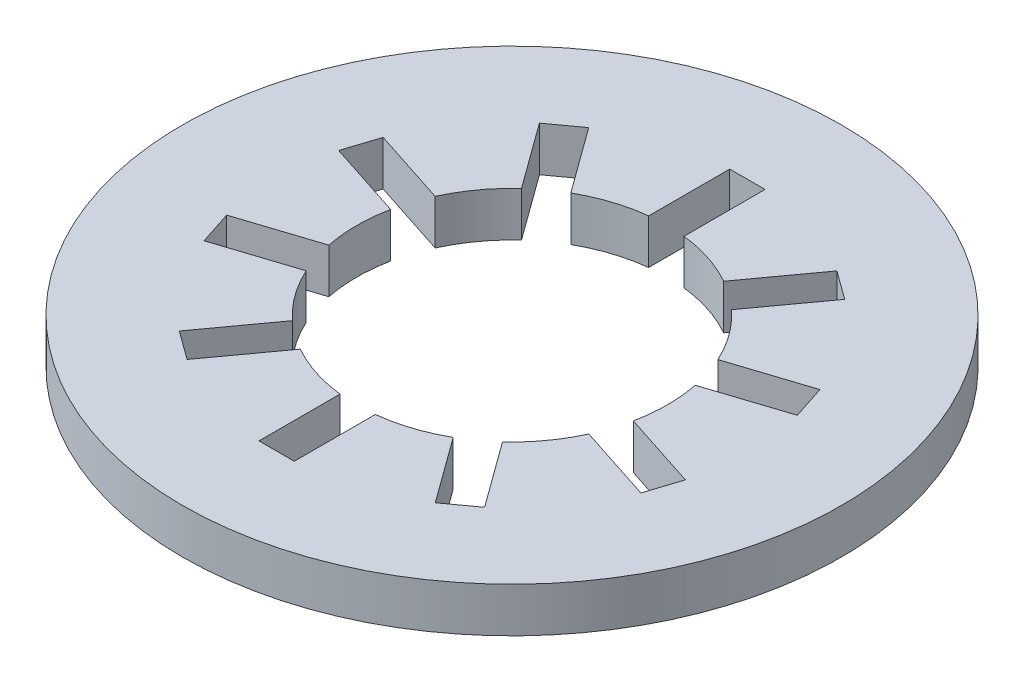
from build123d import *

# Parameters (mm, degrees)
SKETCH_1_R      = 3.556
EXTRUDE_1_DEPTH = 0.4826


with BuildPart() as part:
    # Sketch 1 → Extrude 1 (new body)
    with BuildSketch(Plane(origin=(0, 0, 0), x_dir=(1, 0, 0), z_dir=(0, 1, 0))):
        with Locations(Location((0, 0, 0), (0, 0, 90))):
            Circle(SKETCH_1_R)
        with BuildLine():
            Line((1.647092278, 1.942930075), (1.133098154, 1.235477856))
            ThreePointArc((1.133098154, 1.235477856), (1.356236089, 0.985363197), (1.525155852, 0.69585673))
            Line((1.525155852, 0.69585673), (2.356815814, 0.966079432))
            Line((2.356815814, 0.966079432), (2.474551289, 0.603726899))
            Line((2.474551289, 0.603726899), (1.642891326, 0.333504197))
            ThreePointArc((1.642891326, 0.333504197), (1.6764, 0), (1.642891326, -0.333504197))
            Line((1.642891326, -0.333504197), (2.474551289, -0.603726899))
            Line((2.474551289, -0.603726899), (2.356815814, -0.966079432))
            Line((2.356815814, -0.966079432), (1.525155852, -0.69585673))
            ThreePointArc((1.525155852, -0.69585673), (1.356236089, -0.985363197), (1.133098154, -1.235477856))
            Line((1.133098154, -1.235477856), (1.647092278, -1.942930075))
            Line((1.647092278, -1.942930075), (1.338856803, -2.166876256))
            Line((1.338856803, -2.166876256), (0.82486268, -1.459424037))
            ThreePointArc((0.82486268, -1.459424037), (0.518036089, -1.594351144), (0.1905, -1.665540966))
            Line((0.1905, -1.665540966), (0.1905, -2.54))
            Line((0.1905, -2.54), (-0.1905, -2.54))
            Line((-0.1905, -2.54), (-0.1905, -1.665540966))
            ThreePointArc((-0.1905, -1.665540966), (-0.518036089, -1.594351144), (-0.82486268, -1.459424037))
            Line((-0.82486268, -1.459424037), (-1.338856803, -2.166876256))
            Line((-1.338856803, -2.166876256), (-1.647092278, -1.942930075))
            Line((-1.647092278, -1.942930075), (-1.133098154, -1.235477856))
            ThreePointArc((-1.133098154, -1.235477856), (-1.356236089, -0.985363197), (-1.525155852, -0.69585673))
            Line((-1.525155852, -0.69585673), (-2.356815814, -0.966079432))
            Line((-2.356815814, -0.966079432), (-2.474551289, -0.603726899))
            Line((-2.474551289, -0.603726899), (-1.642891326, -0.333504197))
            ThreePointArc((-1.642891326, -0.333504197), (-1.6764, 0), (-1.642891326, 0.333504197))
            Line((-1.642891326, 0.333504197), (-2.474551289, 0.603726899))
            Line((-2.474551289, 0.603726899), (-2.356815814, 0.966079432))
            Line((-2.356815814, 0.966079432), (-1.525155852, 0.69585673))
            ThreePointArc((-1.525155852, 0.69585673), (-1.356236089, 0.985363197), (-1.133098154, 1.235477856))
            Line((-1.133098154, 1.235477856), (-1.647092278, 1.942930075))
            Line((-1.647092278, 1.942930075), (-1.338856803, 2.166876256))
            Line((-1.338856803, 2.166876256), (-0.82486268, 1.459424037))
            ThreePointArc((-0.82486268, 1.459424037), (-0.518036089, 1.594351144), (-0.1905, 1.665540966))
            Line((-0.1905, 1.665540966), (-0.1905, 2.54))
            Line((-0.1905, 2.54), (0.1905, 2.54))
            Line((0.1905, 2.54), (0.1905, 1.665540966))
            ThreePointArc((0.1905, 1.665540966), (0.518036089, 1.594351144), (0.82486268, 1.459424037))
            Line((0.82486268, 1.459424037), (1.338856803, 2.166876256))
            Line((1.338856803, 2.166876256), (1.647092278, 1.942930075))
        make_face(mode=Mode.SUBTRACT)
    extrude(amount=EXTRUDE_1_DEPTH)


solid = part.part
